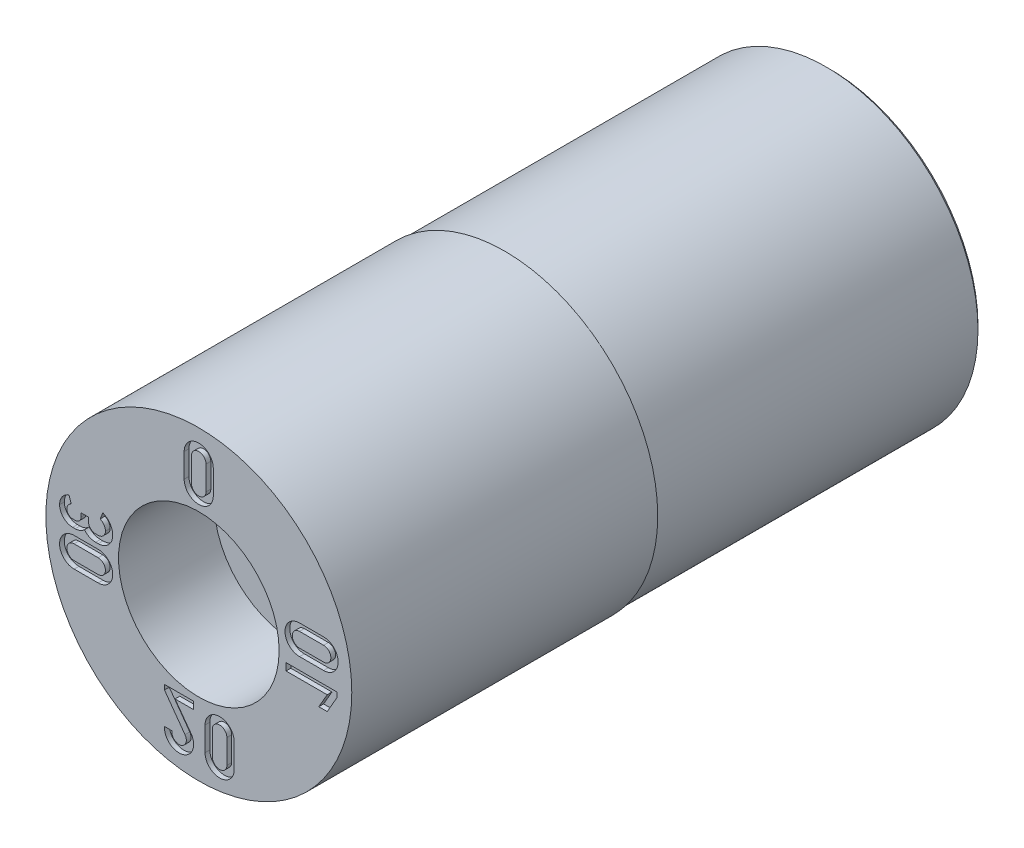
from build123d import *

# Parameters (mm, degrees)
SKETCH4_W          = 17
SKETCH4_H          = 1
CUT_EXTRUDE1_DEPTH = 0.25
CUT_EXTRUDE2_DEPTH = 4


with BuildPart() as part:
    # Sketch1 → Revolve1 (revolve)
    with BuildSketch(Plane(origin=(0, 0, 0), x_dir=(0, 0, -1), z_dir=(1, 0, 0)), mode=Mode.PRIVATE) as revolve1_sk:
        Polygon((0, 8), (0, 4.2), (5, 4.2), (5, 1.75), (25, 1.75), (25, 4), (33, 4), (33, 7.75), (32.75, 8), align=None)
    revolve(revolve1_sk.sketch.rotate(Axis((0, 0, 3.797909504), (0, 0, -1)), 90), axis=Axis((0, 0, 3.797909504), (0, 0, -1)))

    # Sketch4 → Cut-Revolve1 (revolve, cut)
    with BuildSketch(Plane(origin=(0, 0, 0), x_dir=(0, 0, -1), z_dir=(1, 0, 0)), mode=Mode.PRIVATE) as cut_revolve1_sk:
        with Locations((24.5, 8.435)):
            Rectangle(SKETCH4_W, SKETCH4_H)
    revolve(cut_revolve1_sk.sketch.rotate(Axis((0, 0, 0), (0, 0, -1)), 90), axis=Axis((0, 0, 0), (0, 0, -1)), mode=Mode.SUBTRACT)

    # Sketch2 → Cut-Extrude1 (cut)
    # profile 1 of 7: a face of its own
    with BuildSketch(Plane.XY):
        with BuildLine():
            Line((1.850252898, -6.554972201), (1.850360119, -5.298385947))
            ThreePointArc((1.850360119, -5.298385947), (1.088513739, -4.536588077), (0.326751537, -5.298470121))
            Line((0.326751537, -5.298470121), (0.326857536, -6.555100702))
            ThreePointArc((0.326857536, -6.555100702), (1.088619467, -7.316734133), (1.850252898, -6.554972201))
        make_face()
        with BuildLine():
            Line((0.707706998, -5.298437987), (0.707812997, -6.555068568))
            ThreePointArc((0.707812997, -6.555068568), (1.088587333, -6.935778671), (1.469297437, -6.555004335))
            Line((1.469297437, -6.555004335), (1.469404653, -5.298346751))
            ThreePointArc((1.469404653, -5.298346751), (1.088510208, -4.917543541), (0.707706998, -5.298437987))
        make_face(mode=Mode.SUBTRACT)
    # profile 2 of 7: a face of its own
    with BuildSketch(Plane.XY):
        with BuildLine():
            Line((-5.264210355, 0.49684583), (-5.397489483, 0.496857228))
            ThreePointArc((-5.397489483, 0.496857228), (-5.666673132, 0.608383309), (-5.778153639, 0.877585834))
            Line((-5.778153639, 0.877585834), (-5.778137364, 1.0679498))
            Line((-5.778137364, 1.0679498), (-6.158986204, 1.067982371))
            Line((-6.158986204, 1.067982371), (-6.15900248, 0.877664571))
            ThreePointArc((-6.15900248, 0.877664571), (-6.248240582, 0.662276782), (-6.463643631, 0.573075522))
            Line((-6.463643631, 0.573075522), (-6.596904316, 0.573086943))
            ThreePointArc((-6.596904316, 0.573086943), (-6.812216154, 0.662400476), (-6.901508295, 0.877721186))
            ThreePointArc((-6.901508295, 0.877721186), (-6.83730876, 1.077576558), (-6.668513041, 1.202363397))
            Line((-6.668513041, 1.202363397), (-6.790351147, 1.56318251))
            ThreePointArc((-6.790351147, 1.56318251), (-7.146531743, 1.299600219), (-7.282311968, 0.877813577))
            ThreePointArc((-7.282311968, 0.877813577), (-7.081630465, 0.393034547), (-6.596899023, 0.192238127))
            Line((-6.596899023, 0.192238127), (-6.463676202, 0.192226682))
            ThreePointArc((-6.463676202, 0.192226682), (-6.203512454, 0.243519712), (-5.98231136, 0.389760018))
            ThreePointArc((-5.98231136, 0.389760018), (-5.72037079, 0.187809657), (-5.397506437, 0.116008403))
            Line((-5.397506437, 0.116008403), (-5.2641785, 0.115997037))
            ThreePointArc((-5.2641785, 0.115997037), (-4.72568691, 0.339015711), (-4.502651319, 0.877500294))
            ThreePointArc((-4.502651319, 0.877500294), (-4.644494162, 1.338104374), (-5.020845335, 1.639161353))
            Line((-5.020845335, 1.639161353), (-5.160593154, 1.285045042))
            ThreePointArc((-5.160593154, 1.285045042), (-4.959254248, 1.124004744), (-4.883393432, 0.877597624))
            ThreePointArc((-4.883393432, 0.877597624), (-4.994945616, 0.60835196), (-5.264210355, 0.49684583))
        make_face()
    # profile 3 of 7: a face of its own
    with BuildSketch(Plane.XY):
        with BuildLine():
            Line((6.524911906, 1.792207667), (5.268312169, 1.792100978))
            ThreePointArc((5.268312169, 1.792100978), (4.506679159, 1.030354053), (5.268410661, 0.268705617))
            Line((5.268410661, 0.268705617), (6.525041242, 0.268812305))
            ThreePointArc((6.525041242, 0.268812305), (7.286674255, 1.030574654), (6.524911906, 1.792207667))
        make_face()
        with BuildLine():
            Line((5.268378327, 0.649554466), (6.525008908, 0.649661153))
            ThreePointArc((6.525008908, 0.649661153), (6.905825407, 1.03054232), (6.52494424, 1.411358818))
            Line((6.52494424, 1.411358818), (5.268286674, 1.411252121))
            ThreePointArc((5.268286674, 1.411252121), (4.887528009, 1.030357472), (5.268378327, 0.649554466))
        make_face(mode=Mode.SUBTRACT)
    # profile 4 of 7: a face of its own
    with BuildSketch(Plane.XY):
        Polygon((7.22685335, -0.355309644), (7.226874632, -0.605974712), (6.714211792, -1.497686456), (6.275041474, -1.497723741), (6.712761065, -0.736095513), (4.561370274, -0.736278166), (4.561337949, -0.355535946), align=None)
    # profile 5 of 7: a face of its own
    with BuildSketch(Plane.XY):
        with BuildLine():
            Line((-0.272574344, -4.902683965), (-0.272606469, -4.521829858))
            Line((-0.272606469, -4.521829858), (-1.79578859, -4.521958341))
            Line((-1.79578859, -4.521958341), (-1.795767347, -4.773796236))
            Line((-1.795767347, -4.773796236), (-0.724851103, -6.260317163))
            ThreePointArc((-0.724851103, -6.260317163), (-0.94451028, -6.85321422), (-1.410481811, -6.425841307))
            Line((-1.410481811, -6.425841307), (-1.793495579, -6.425882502))
            ThreePointArc((-1.793495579, -6.425882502), (-0.826975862, -7.215859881), (-0.415379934, -6.0373806))
            Line((-0.415379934, -6.0373806), (-1.243673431, -4.902765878))
            Line((-1.243673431, -4.902765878), (-0.272574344, -4.902683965))
        make_face()
    # profile 6 of 7: a face of its own
    with BuildSketch(Plane.XY):
        with BuildLine():
            Line((-0.766117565, 6.542085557), (-0.766011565, 5.285485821))
            ThreePointArc((-0.766011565, 5.285485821), (-0.004393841, 4.523914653), (0.757170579, 5.285539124))
            Line((0.757170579, 5.285539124), (0.757277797, 6.542214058))
            ThreePointArc((0.757277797, 6.542214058), (-0.004484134, 7.303847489), (-0.766117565, 6.542085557))
        make_face()
        with BuildLine():
            Line((0.376428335, 5.285551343), (0.376322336, 6.542181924))
            ThreePointArc((0.376322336, 6.542181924), (-0.004452, 6.922892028), (-0.385162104, 6.542117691))
            Line((-0.385162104, 6.542117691), (-0.385269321, 5.285460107))
            ThreePointArc((-0.385269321, 5.285460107), (-0.004374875, 4.904656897), (0.376428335, 5.285551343))
        make_face(mode=Mode.SUBTRACT)
    # profile 7 of 7: a face of its own
    with BuildSketch(Plane.XY):
        with BuildLine():
            Line((-6.521731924, -0.138210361), (-5.265132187, -0.13831783))
            ThreePointArc((-5.265132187, -0.13831783), (-4.503484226, -0.90006523), (-5.265231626, -1.661713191))
            Line((-5.265231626, -1.661713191), (-6.521862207, -1.661605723))
            ThreePointArc((-6.521862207, -1.661605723), (-7.283494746, -0.899842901), (-6.521731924, -0.138210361))
        make_face()
        with BuildLine():
            Line((-5.265241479, -1.28097095), (-6.521829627, -1.280650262))
            ThreePointArc((-6.521829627, -1.280650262), (-6.902539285, -0.89987548), (-6.521764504, -0.519165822))
            Line((-6.521764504, -0.519165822), (-5.265106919, -0.519060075))
            ThreePointArc((-5.265106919, -0.519060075), (-4.884226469, -0.900082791), (-5.265241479, -1.28097095))
        make_face(mode=Mode.SUBTRACT)
    extrude(amount=-CUT_EXTRUDE1_DEPTH, mode=Mode.SUBTRACT)

    # Sketch3 → Cut-Extrude2 (cut)
    with BuildSketch(Plane.XY.offset(-5)):
        Polygon((1.010362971, 1.75), (-1.010362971, 1.75), (-2.020725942, 0), (-1.010362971, -1.75), (1.010362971, -1.75), (2.020725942, 0), align=None)
    extrude(amount=-CUT_EXTRUDE2_DEPTH, mode=Mode.SUBTRACT)


solid = part.part
